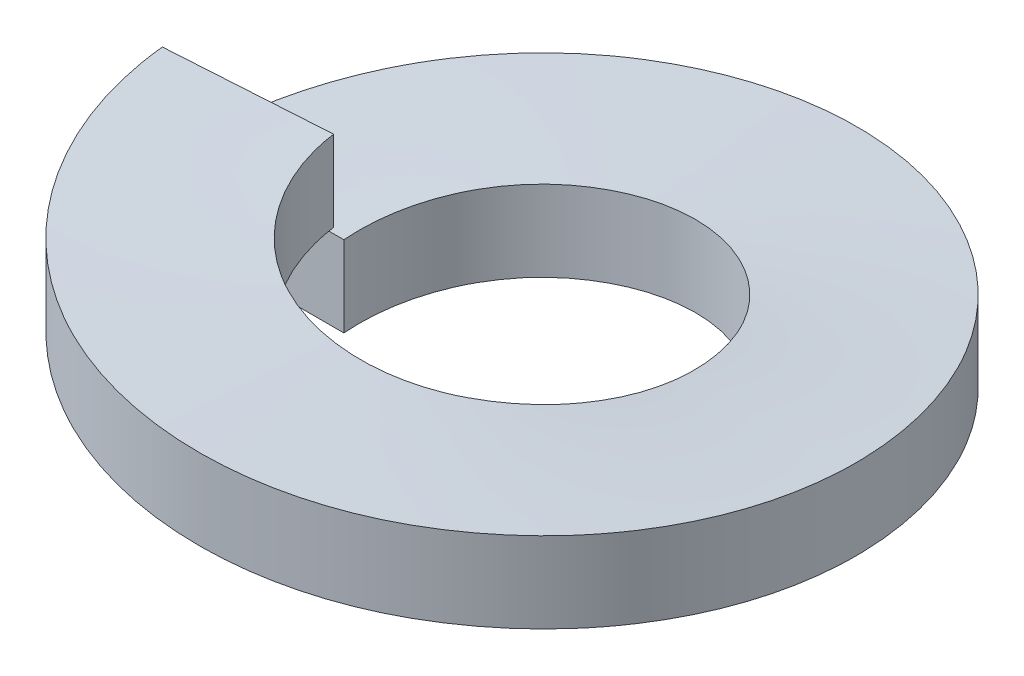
ISO-10303-21;
HEADER;
FILE_DESCRIPTION(('STEP AP214'),'2;1');
FILE_NAME('part.step','',(''),(''),'','','');
FILE_SCHEMA(('AUTOMOTIVE_DESIGN { 1 0 10303 214 1 1 1 1 }'));
ENDSEC;
DATA;
#1=APPLICATION_CONTEXT('core data for automotive mechanical design processes');
#2=APPLICATION_PROTOCOL_DEFINITION('international standard','automotive_design',2000,#1);
#3=PRODUCT_CONTEXT('',#1,'mechanical');
#4=PRODUCT('Part','Part','',(#3));
#5=PRODUCT_RELATED_PRODUCT_CATEGORY('part','',(#4));
#6=PRODUCT_DEFINITION_FORMATION('','',#4);
#7=PRODUCT_DEFINITION_CONTEXT('part definition',#1,'design');
#8=PRODUCT_DEFINITION('design','',#6,#7);
#9=PRODUCT_DEFINITION_SHAPE('','',#8);
#10=(LENGTH_UNIT() NAMED_UNIT(*) SI_UNIT(.MILLI.,.METRE.));
#11=(NAMED_UNIT(*) PLANE_ANGLE_UNIT() SI_UNIT($,.RADIAN.));
#12=(NAMED_UNIT(*) SI_UNIT($,.STERADIAN.) SOLID_ANGLE_UNIT());
#13=UNCERTAINTY_MEASURE_WITH_UNIT(LENGTH_MEASURE(1.E-05),#10,'distance_accuracy_value','');
#14=(GEOMETRIC_REPRESENTATION_CONTEXT(3) GLOBAL_UNCERTAINTY_ASSIGNED_CONTEXT((#13)) GLOBAL_UNIT_ASSIGNED_CONTEXT((#10,
#11,#12)) REPRESENTATION_CONTEXT('',''));
#15=CARTESIAN_POINT('',(0.,0.,0.));
#16=DIRECTION('',(0.,0.,1.));
#17=DIRECTION('',(1.,0.,0.));
#18=AXIS2_PLACEMENT_3D('',#15,#16,#17);
#19=CARTESIAN_POINT('',(-6.223,0.,0.));
#20=DIRECTION('',(0.,0.,1.));
#21=DIRECTION('',(1.,0.,0.));
#22=AXIS2_PLACEMENT_3D('',#19,#20,#21);
#23=PLANE('',#22);
#24=DIRECTION('',(0.,-1.,0.));
#25=VECTOR('',#24,1.);
#26=CARTESIAN_POINT('',(-6.223,1.524,0.));
#27=LINE('',#26,#25);
#28=CARTESIAN_POINT('',(-6.223,1.524,0.));
#29=VERTEX_POINT('',#28);
#30=CARTESIAN_POINT('',(-6.223,0.,0.));
#31=VERTEX_POINT('',#30);
#32=EDGE_CURVE('E87',#29,#31,#27,.T.);
#33=ORIENTED_EDGE('',*,*,#32,.T.);
#34=DIRECTION('',(1.,0.,0.));
#35=VECTOR('',#34,1.);
#36=CARTESIAN_POINT('',(-6.223,0.,0.));
#37=LINE('',#36,#35);
#38=CARTESIAN_POINT('',(-3.175,0.,0.));
#39=VERTEX_POINT('',#38);
#40=EDGE_CURVE('E80',#31,#39,#37,.T.);
#41=ORIENTED_EDGE('',*,*,#40,.T.);
#42=DIRECTION('',(0.,1.,0.));
#43=VECTOR('',#42,1.);
#44=CARTESIAN_POINT('',(-3.175,1.524,0.));
#45=LINE('',#44,#43);
#46=CARTESIAN_POINT('',(-3.175,1.524,0.));
#47=VERTEX_POINT('',#46);
#48=EDGE_CURVE('E75',#39,#47,#45,.T.);
#49=ORIENTED_EDGE('',*,*,#48,.T.);
#50=DIRECTION('',(-1.,0.,0.));
#51=VECTOR('',#50,1.);
#52=CARTESIAN_POINT('',(-6.223,1.524,0.));
#53=LINE('',#52,#51);
#54=EDGE_CURVE('E70',#47,#29,#53,.T.);
#55=ORIENTED_EDGE('',*,*,#54,.T.);
#56=EDGE_LOOP('',(#33,#41,#49,#55));
#57=FACE_BOUND('',#56,.T.);
#58=ADVANCED_FACE('F35',(#57),#23,.T.);
#59=CARTESIAN_POINT('',(-6.21072033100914,1.8288,0.390745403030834));
#60=DIRECTION('',(0.0627905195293,0.,0.998026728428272));
#61=DIRECTION('',(0.998026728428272,0.,-0.0627905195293));
#62=AXIS2_PLACEMENT_3D('',#59,#60,#61);
#63=PLANE('',#62);
#64=DIRECTION('',(0.,-1.,0.));
#65=VECTOR('',#64,1.);
#66=CARTESIAN_POINT('',(-6.21072033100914,3.3528,0.390745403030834));
#67=LINE('',#66,#65);
#68=CARTESIAN_POINT('',(-6.21072033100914,3.3528,0.390745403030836));
#69=VERTEX_POINT('',#68);
#70=CARTESIAN_POINT('',(-6.21072033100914,1.8288,0.390745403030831));
#71=VERTEX_POINT('',#70);
#72=EDGE_CURVE('E95',#69,#71,#67,.T.);
#73=ORIENTED_EDGE('',*,*,#72,.F.);
#74=DIRECTION('',(-0.998026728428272,0.,0.0627905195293));
#75=VECTOR('',#74,1.);
#76=CARTESIAN_POINT('',(-6.21072033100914,3.3528,0.390745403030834));
#77=LINE('',#76,#75);
#78=CARTESIAN_POINT('',(-3.16873486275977,3.3528,0.199359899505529));
#79=VERTEX_POINT('',#78);
#80=EDGE_CURVE('E11',#79,#69,#77,.T.);
#81=ORIENTED_EDGE('',*,*,#80,.F.);
#82=DIRECTION('',(0.,1.,0.));
#83=VECTOR('',#82,1.);
#84=CARTESIAN_POINT('',(-3.16873486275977,3.3528,0.199359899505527));
#85=LINE('',#84,#83);
#86=CARTESIAN_POINT('',(-3.16873486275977,1.8288,0.199359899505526));
#87=VERTEX_POINT('',#86);
#88=EDGE_CURVE('E49',#87,#79,#85,.T.);
#89=ORIENTED_EDGE('',*,*,#88,.F.);
#90=DIRECTION('',(0.998026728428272,0.,-0.0627905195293));
#91=VECTOR('',#90,1.);
#92=CARTESIAN_POINT('',(-6.21072033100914,1.8288,0.390745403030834));
#93=LINE('',#92,#91);
#94=EDGE_CURVE('E58',#71,#87,#93,.T.);
#95=ORIENTED_EDGE('',*,*,#94,.F.);
#96=EDGE_LOOP('',(#73,#81,#89,#95));
#97=FACE_BOUND('',#96,.T.);
#98=ADVANCED_FACE('F141',(#97),#63,.F.);
#99=CARTESIAN_POINT('',(0.,0.,0.));
#100=DIRECTION('',(0.,1.,0.));
#101=DIRECTION('',(0.,0.,1.));
#102=AXIS2_PLACEMENT_3D('',#99,#100,#101);
#103=CYLINDRICAL_SURFACE('',#102,6.223);
#104=CARTESIAN_POINT('',(-6.223,0.,0.));
#105=CARTESIAN_POINT('',(-6.223,0.1524,-3.54953653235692));
#106=CARTESIAN_POINT('',(-3.16776473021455,0.3048,-5.35639763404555));
#107=CARTESIAN_POINT('',(-0.112529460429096,0.4572,-7.16325873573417));
#108=CARTESIAN_POINT('',(2.997953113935,0.6096,-5.45325646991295));
#109=CARTESIAN_POINT('',(6.10843568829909,0.762,-3.74325420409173));
#110=CARTESIAN_POINT('',(6.21992932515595,0.9144,-0.195469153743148));
#111=CARTESIAN_POINT('',(6.3314229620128,1.0668,3.35231589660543));
#112=CARTESIAN_POINT('',(3.33445014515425,1.2192,5.25425268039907));
#113=CARTESIAN_POINT('',(0.33747732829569,1.3716,7.15618946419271));
#114=CARTESIAN_POINT('',(-2.82518287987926,1.524,5.54473360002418));
#115=CARTESIAN_POINT('',(-5.98784308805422,1.6764,3.93327773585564));
#116=CARTESIAN_POINT('',(-6.21072033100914,1.8288,0.390745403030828));
#117=(BOUNDED_CURVE() B_SPLINE_CURVE(2,(#104,#105,#106,#107,#108,#109,#110,#111,#112,#113,#114,
#115,#116),.UNSPECIFIED.,.F.,.F.) B_SPLINE_CURVE_WITH_KNOTS((3,2,2,2,2,2,3),(0.,
0.166666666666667,0.333333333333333,0.5,0.666666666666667,0.833333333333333,1.),
.UNSPECIFIED.) CURVE() GEOMETRIC_REPRESENTATION_ITEM() RATIONAL_B_SPLINE_CURVE((1.,
0.868631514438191,1.,0.868631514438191,1.,0.868631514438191,1.,0.868631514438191,1.,
0.868631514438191,1.,0.868631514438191,1.)) REPRESENTATION_ITEM(''));
#118=EDGE_CURVE('E90',#31,#71,#117,.T.);
#119=ORIENTED_EDGE('',*,*,#118,.F.);
#120=ORIENTED_EDGE('',*,*,#32,.F.);
#121=CARTESIAN_POINT('',(-6.223,1.524,0.));
#122=CARTESIAN_POINT('',(-6.223,1.6764,-3.54953653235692));
#123=CARTESIAN_POINT('',(-3.16776473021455,1.8288,-5.35639763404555));
#124=CARTESIAN_POINT('',(-0.112529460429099,1.9812,-7.16325873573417));
#125=CARTESIAN_POINT('',(2.997953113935,2.1336,-5.45325646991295));
#126=CARTESIAN_POINT('',(6.10843568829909,2.286,-3.74325420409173));
#127=CARTESIAN_POINT('',(6.21992932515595,2.4384,-0.195469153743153));
#128=CARTESIAN_POINT('',(6.3314229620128,2.5908,3.35231589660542));
#129=CARTESIAN_POINT('',(3.33445014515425,2.7432,5.25425268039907));
#130=CARTESIAN_POINT('',(0.337477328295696,2.8956,7.15618946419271));
#131=CARTESIAN_POINT('',(-2.82518287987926,3.048,5.54473360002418));
#132=CARTESIAN_POINT('',(-5.98784308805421,3.2004,3.93327773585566));
#133=CARTESIAN_POINT('',(-6.21072033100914,3.3528,0.390745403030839));
#134=(BOUNDED_CURVE() B_SPLINE_CURVE(2,(#121,#122,#123,#124,#125,#126,#127,#128,#129,#130,#131,
#132,#133),.UNSPECIFIED.,.F.,.F.) B_SPLINE_CURVE_WITH_KNOTS((3,2,2,2,2,2,3),(0.,
0.166666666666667,0.333333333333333,0.5,0.666666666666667,0.833333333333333,1.),
.UNSPECIFIED.) CURVE() GEOMETRIC_REPRESENTATION_ITEM() RATIONAL_B_SPLINE_CURVE((1.,
0.868631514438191,1.,0.868631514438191,1.,0.868631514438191,1.,0.868631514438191,1.,
0.868631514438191,1.,0.868631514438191,1.)) REPRESENTATION_ITEM(''));
#135=EDGE_CURVE('E89',#29,#69,#134,.T.);
#136=ORIENTED_EDGE('',*,*,#135,.T.);
#137=ORIENTED_EDGE('',*,*,#72,.T.);
#138=EDGE_LOOP('',(#119,#120,#136,#137));
#139=FACE_BOUND('',#138,.T.);
#140=ADVANCED_FACE('F88',(#139),#103,.T.);
#141=CARTESIAN_POINT('',(-6.223,0.,0.));
#142=CARTESIAN_POINT('',(-6.223,0.1524,-3.54953653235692));
#143=CARTESIAN_POINT('',(-3.16776473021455,0.3048,-5.35639763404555));
#144=CARTESIAN_POINT('',(-0.112529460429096,0.4572,-7.16325873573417));
#145=CARTESIAN_POINT('',(2.997953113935,0.6096,-5.45325646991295));
#146=CARTESIAN_POINT('',(6.10843568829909,0.762,-3.74325420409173));
#147=CARTESIAN_POINT('',(6.21992932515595,0.9144,-0.195469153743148));
#148=CARTESIAN_POINT('',(6.3314229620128,1.0668,3.35231589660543));
#149=CARTESIAN_POINT('',(3.33445014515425,1.2192,5.25425268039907));
#150=CARTESIAN_POINT('',(0.33747732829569,1.3716,7.15618946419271));
#151=CARTESIAN_POINT('',(-2.82518287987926,1.524,5.54473360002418));
#152=CARTESIAN_POINT('',(-5.98784308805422,1.6764,3.93327773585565));
#153=CARTESIAN_POINT('',(-6.21072033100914,1.8288,0.390745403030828));
#154=CARTESIAN_POINT('',(-3.175,0.,0.));
#155=CARTESIAN_POINT('',(-3.175,0.1524,-1.81098802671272));
#156=CARTESIAN_POINT('',(-1.61620649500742,0.3048,-2.73285593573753));
#157=CARTESIAN_POINT('',(-0.0574129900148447,0.4572,-3.65472384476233));
#158=CARTESIAN_POINT('',(1.52956791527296,0.6096,-2.78227370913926));
#159=CARTESIAN_POINT('',(3.11654882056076,0.762,-1.90982357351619));
#160=CARTESIAN_POINT('',(3.1734333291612,0.9144,-0.0997291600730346));
#161=CARTESIAN_POINT('',(3.23031783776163,1.0668,1.71036525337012));
#162=CARTESIAN_POINT('',(1.70125007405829,1.2192,2.68074116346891));
#163=CARTESIAN_POINT('',(0.172182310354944,1.3716,3.65111707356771));
#164=CARTESIAN_POINT('',(-1.44141983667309,1.524,2.82894571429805));
#165=CARTESIAN_POINT('',(-3.05502198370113,1.6764,2.00677435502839));
#166=CARTESIAN_POINT('',(-3.16873486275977,1.8288,0.199359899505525));
#167=(BOUNDED_SURFACE() B_SPLINE_SURFACE(1,2,((#141,#142,#143,#144,#145,#146,#147,#148,#149,
#150,#151,#152,#153),(#154,#155,#156,#157,#158,#159,#160,#161,#162,#163,#164,#165,#166)),
.UNSPECIFIED.,.F.,.F.,.F.) B_SPLINE_SURFACE_WITH_KNOTS((2,2),(3,2,2,2,2,2,3),(0.,1.),(0.,
0.166666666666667,0.333333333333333,0.5,0.666666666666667,0.833333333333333,1.),
.UNSPECIFIED.) GEOMETRIC_REPRESENTATION_ITEM() RATIONAL_B_SPLINE_SURFACE(((1.,0.868631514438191,
1.,0.868631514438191,1.,0.868631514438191,1.,0.868631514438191,1.,0.868631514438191,1.,
0.868631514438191,1.),(1.,0.868631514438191,1.,0.868631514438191,1.,0.868631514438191,1.,
0.868631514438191,1.,0.868631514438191,1.,0.868631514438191,1.))) REPRESENTATION_ITEM('') SURFACE());
#168=CARTESIAN_POINT('',(-3.175,0.,0.));
#169=CARTESIAN_POINT('',(-3.175,0.1524,-1.81098802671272));
#170=CARTESIAN_POINT('',(-1.61620649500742,0.3048,-2.73285593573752));
#171=CARTESIAN_POINT('',(-0.0574129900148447,0.4572,-3.65472384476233));
#172=CARTESIAN_POINT('',(1.52956791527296,0.6096,-2.78227370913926));
#173=CARTESIAN_POINT('',(3.11654882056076,0.762,-1.90982357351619));
#174=CARTESIAN_POINT('',(3.1734333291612,0.9144,-0.0997291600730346));
#175=CARTESIAN_POINT('',(3.23031783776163,1.0668,1.71036525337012));
#176=CARTESIAN_POINT('',(1.70125007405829,1.2192,2.68074116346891));
#177=CARTESIAN_POINT('',(0.172182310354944,1.3716,3.65111707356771));
#178=CARTESIAN_POINT('',(-1.44141983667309,1.524,2.82894571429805));
#179=CARTESIAN_POINT('',(-3.05502198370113,1.6764,2.00677435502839));
#180=CARTESIAN_POINT('',(-3.16873486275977,1.8288,0.199359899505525));
#181=(BOUNDED_CURVE() B_SPLINE_CURVE(2,(#168,#169,#170,#171,#172,#173,#174,#175,#176,#177,#178,
#179,#180),.UNSPECIFIED.,.F.,.F.) B_SPLINE_CURVE_WITH_KNOTS((3,2,2,2,2,2,3),(0.,
0.166666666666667,0.333333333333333,0.5,0.666666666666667,0.833333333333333,1.),
.UNSPECIFIED.) CURVE() GEOMETRIC_REPRESENTATION_ITEM() RATIONAL_B_SPLINE_CURVE((1.,
0.868631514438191,1.,0.868631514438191,1.,0.868631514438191,1.,0.868631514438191,1.,
0.868631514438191,1.,0.868631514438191,1.)) REPRESENTATION_ITEM(''));
#182=EDGE_CURVE('E110',#39,#87,#181,.T.);
#183=ORIENTED_EDGE('',*,*,#182,.F.);
#184=ORIENTED_EDGE('',*,*,#40,.F.);
#185=ORIENTED_EDGE('',*,*,#118,.T.);
#186=ORIENTED_EDGE('',*,*,#94,.T.);
#187=EDGE_LOOP('',(#183,#184,#185,#186));
#188=FACE_BOUND('',#187,.T.);
#189=ADVANCED_FACE('F128',(#188),#167,.F.);
#190=CARTESIAN_POINT('',(0.,0.,0.));
#191=DIRECTION('',(0.,1.,0.));
#192=DIRECTION('',(0.,0.,1.));
#193=AXIS2_PLACEMENT_3D('',#190,#191,#192);
#194=CYLINDRICAL_SURFACE('',#193,3.175);
#195=CARTESIAN_POINT('',(-3.175,1.524,0.));
#196=CARTESIAN_POINT('',(-3.175,1.6764,-1.81098802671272));
#197=CARTESIAN_POINT('',(-1.61620649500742,1.8288,-2.73285593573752));
#198=CARTESIAN_POINT('',(-0.0574129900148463,1.9812,-3.65472384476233));
#199=CARTESIAN_POINT('',(1.52956791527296,2.1336,-2.78227370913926));
#200=CARTESIAN_POINT('',(3.11654882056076,2.286,-1.90982357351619));
#201=CARTESIAN_POINT('',(3.1734333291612,2.4384,-0.0997291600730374));
#202=CARTESIAN_POINT('',(3.23031783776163,2.5908,1.71036525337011));
#203=CARTESIAN_POINT('',(1.70125007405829,2.7432,2.68074116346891));
#204=CARTESIAN_POINT('',(0.172182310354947,2.8956,3.65111707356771));
#205=CARTESIAN_POINT('',(-1.44141983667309,3.048,2.82894571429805));
#206=CARTESIAN_POINT('',(-3.05502198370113,3.2004,2.0067743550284));
#207=CARTESIAN_POINT('',(-3.16873486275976,3.3528,0.19935989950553));
#208=(BOUNDED_CURVE() B_SPLINE_CURVE(2,(#195,#196,#197,#198,#199,#200,#201,#202,#203,#204,#205,
#206,#207),.UNSPECIFIED.,.F.,.F.) B_SPLINE_CURVE_WITH_KNOTS((3,2,2,2,2,2,3),(0.,
0.166666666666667,0.333333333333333,0.5,0.666666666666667,0.833333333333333,1.),
.UNSPECIFIED.) CURVE() GEOMETRIC_REPRESENTATION_ITEM() RATIONAL_B_SPLINE_CURVE((1.,
0.868631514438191,1.,0.868631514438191,1.,0.868631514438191,1.,0.868631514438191,1.,
0.868631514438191,1.,0.868631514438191,1.)) REPRESENTATION_ITEM(''));
#209=EDGE_CURVE('E42',#47,#79,#208,.T.);
#210=ORIENTED_EDGE('',*,*,#209,.F.);
#211=ORIENTED_EDGE('',*,*,#48,.F.);
#212=ORIENTED_EDGE('',*,*,#182,.T.);
#213=ORIENTED_EDGE('',*,*,#88,.T.);
#214=EDGE_LOOP('',(#210,#211,#212,#213));
#215=FACE_BOUND('',#214,.T.);
#216=ADVANCED_FACE('F126',(#215),#194,.F.);
#217=CARTESIAN_POINT('',(-3.175,1.524,0.));
#218=CARTESIAN_POINT('',(-3.175,1.6764,-1.81098802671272));
#219=CARTESIAN_POINT('',(-1.61620649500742,1.8288,-2.73285593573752));
#220=CARTESIAN_POINT('',(-0.0574129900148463,1.9812,-3.65472384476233));
#221=CARTESIAN_POINT('',(1.52956791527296,2.1336,-2.78227370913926));
#222=CARTESIAN_POINT('',(3.11654882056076,2.286,-1.90982357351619));
#223=CARTESIAN_POINT('',(3.1734333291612,2.4384,-0.0997291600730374));
#224=CARTESIAN_POINT('',(3.23031783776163,2.5908,1.71036525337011));
#225=CARTESIAN_POINT('',(1.70125007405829,2.7432,2.68074116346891));
#226=CARTESIAN_POINT('',(0.172182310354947,2.8956,3.65111707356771));
#227=CARTESIAN_POINT('',(-1.44141983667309,3.048,2.82894571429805));
#228=CARTESIAN_POINT('',(-3.05502198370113,3.2004,2.0067743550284));
#229=CARTESIAN_POINT('',(-3.16873486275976,3.3528,0.19935989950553));
#230=CARTESIAN_POINT('',(-6.223,1.524,0.));
#231=CARTESIAN_POINT('',(-6.223,1.6764,-3.54953653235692));
#232=CARTESIAN_POINT('',(-3.16776473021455,1.8288,-5.35639763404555));
#233=CARTESIAN_POINT('',(-0.112529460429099,1.9812,-7.16325873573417));
#234=CARTESIAN_POINT('',(2.997953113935,2.1336,-5.45325646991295));
#235=CARTESIAN_POINT('',(6.10843568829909,2.286,-3.74325420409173));
#236=CARTESIAN_POINT('',(6.21992932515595,2.4384,-0.195469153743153));
#237=CARTESIAN_POINT('',(6.3314229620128,2.5908,3.35231589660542));
#238=CARTESIAN_POINT('',(3.33445014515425,2.7432,5.25425268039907));
#239=CARTESIAN_POINT('',(0.337477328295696,2.8956,7.15618946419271));
#240=CARTESIAN_POINT('',(-2.82518287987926,3.048,5.54473360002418));
#241=CARTESIAN_POINT('',(-5.98784308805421,3.2004,3.93327773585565));
#242=CARTESIAN_POINT('',(-6.21072033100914,3.3528,0.390745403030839));
#243=(BOUNDED_SURFACE() B_SPLINE_SURFACE(1,2,((#217,#218,#219,#220,#221,#222,#223,#224,#225,
#226,#227,#228,#229),(#230,#231,#232,#233,#234,#235,#236,#237,#238,#239,#240,#241,#242)),
.UNSPECIFIED.,.F.,.F.,.F.) B_SPLINE_SURFACE_WITH_KNOTS((2,2),(3,2,2,2,2,2,3),(0.,1.),(0.,
0.166666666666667,0.333333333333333,0.5,0.666666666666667,0.833333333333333,1.),
.UNSPECIFIED.) GEOMETRIC_REPRESENTATION_ITEM() RATIONAL_B_SPLINE_SURFACE(((1.,0.868631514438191,
1.,0.868631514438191,1.,0.868631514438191,1.,0.868631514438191,1.,0.868631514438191,1.,
0.868631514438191,1.),(1.,0.868631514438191,1.,0.868631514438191,1.,0.868631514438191,1.,
0.868631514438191,1.,0.868631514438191,1.,0.868631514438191,1.))) REPRESENTATION_ITEM('') SURFACE());
#244=ORIENTED_EDGE('',*,*,#80,.T.);
#245=ORIENTED_EDGE('',*,*,#135,.F.);
#246=ORIENTED_EDGE('',*,*,#54,.F.);
#247=ORIENTED_EDGE('',*,*,#209,.T.);
#248=EDGE_LOOP('',(#244,#245,#246,#247));
#249=FACE_BOUND('',#248,.T.);
#250=ADVANCED_FACE('F93',(#249),#243,.F.);
#251=CLOSED_SHELL('',(#58,#98,#140,#189,#216,#250));
#252=MANIFOLD_SOLID_BREP('B2',#251);
#253=ADVANCED_BREP_SHAPE_REPRESENTATION('',(#18,#252),#14);
#254=SHAPE_DEFINITION_REPRESENTATION(#9,#253);
ENDSEC;
END-ISO-10303-21;
